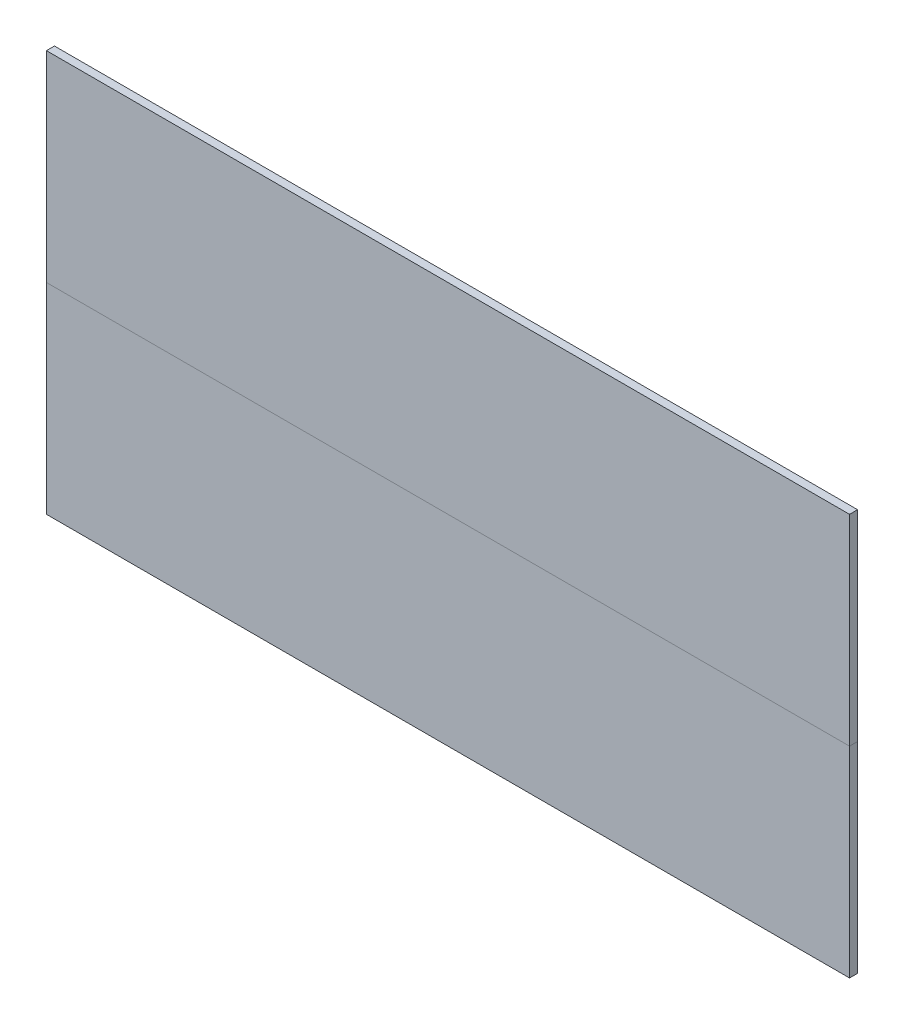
from build123d import *

# Parameters (mm, degrees)
SKETCH1_W           = 100
SKETCH1_H           = 50
BOSS_EXTRUDE1_DEPTH = 1


with BuildPart() as part:
    # Sketch1 → Boss-Extrude1 (new body)
    with BuildSketch(Plane.XY):
        with Locations((50, 25)):
            Rectangle(SKETCH1_W, SKETCH1_H)
    extrude(amount=BOSS_EXTRUDE1_DEPTH)


with BuildPart() as body_2:
    # Split1: the piece on the far side of the plane
    add(part.part)
    split(bisect_by=Plane.ZX.offset(25), keep=Keep.BOTTOM)


with BuildPart() as part_1:
    add(part.part)

    # Split1
    split(bisect_by=Plane.ZX.offset(25), keep=Keep.TOP)


solid = Compound([body_2.part, part_1.part])
